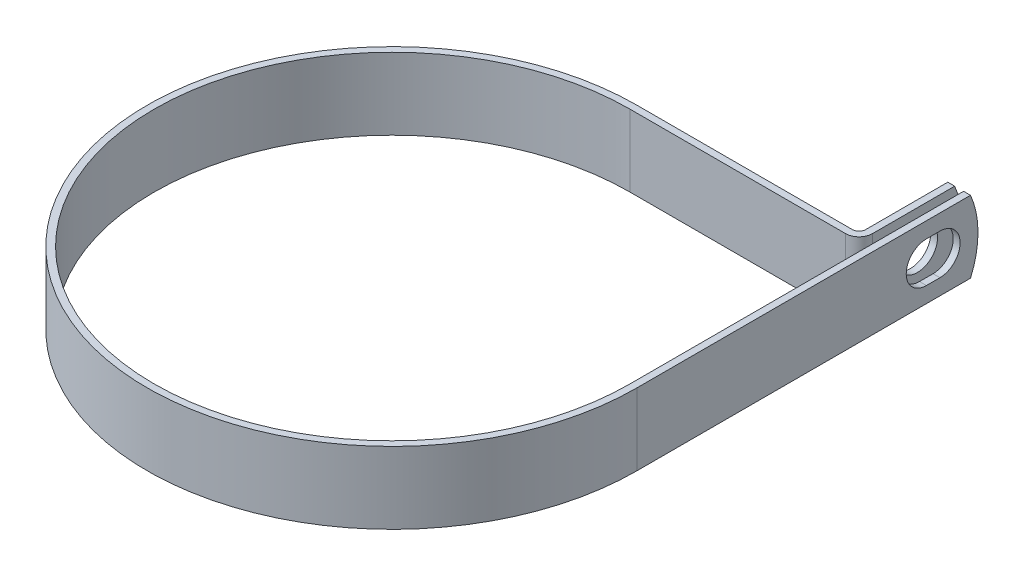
from build123d import *

# Parameters (mm, degrees)
EXTRUDE_THIN1_DEPTH = 6.35
SKETCH2_R           = 3.5687
CUT_EXTRUDE1_DEPTH  = 1.2192
CUT_EXTRUDE2_REACH  = 107.686
CUT_EXTRUDE3_DEPTH  = 103.424932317


with BuildPart() as part:
    # Sketch1 → Extrude-Thin1 (new, symmetric)
    with BuildSketch(Plane(origin=(0, 0, 0), x_dir=(1, 0, 0), z_dir=(0, 1, 0))):
        with BuildLine():
            Line((42.0624, 60.2996), (42.0624, 42.0624))
            Line((42.0624, 42.0624), (42.0624, 0))
            ThreePointArc((42.0624, 0), (-29.742608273, -29.742608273), (0, 42.0624))
            Line((0, 42.0624), (38.11016, 42.0624))
            ThreePointArc((38.11016, 42.0624), (39.791263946, 42.758736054), (40.4876, 44.43984))
            Line((40.4876, 44.43984), (40.4876, 60.2996))
            Line((40.4876, 60.2996), (39.2684, 60.2996))
            Line((39.2684, 60.2996), (39.2684, 44.43984))
            ThreePointArc((39.2684, 44.43984), (38.929159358, 43.620840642), (38.11016, 43.2816))
            Line((38.11016, 43.2816), (0, 43.2816))
            ThreePointArc((0, 43.2816), (-30.604712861, -30.604712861), (43.2816, 0))
            Line((43.2816, 0), (43.2816, 42.0624))
            Line((43.2816, 42.0624), (43.2816, 60.2996))
            Line((43.2816, 60.2996), (42.0624, 60.2996))
        make_face()
    extrude(amount=EXTRUDE_THIN1_DEPTH, both=True)

    # Sketch2 → Cut-Extrude1 (cut)
    with BuildSketch(Plane.ZY.offset(-39.2684)):
        with Locations((-52.3748, 0)):
            Circle(SKETCH2_R)
    extrude(amount=-CUT_EXTRUDE1_DEPTH, mode=Mode.SUBTRACT)

    # Sketch3 → Cut-Extrude2 (cut, up to next)
    with BuildSketch(Plane(origin=(43.2816, 0, 0), x_dir=(0, 0, -1), z_dir=(1, 0, 0)), mode=Mode.PRIVATE) as cut_extrude2_sk1:
        with BuildLine():
            Line((51.181, 3.5687), (53.5686, 3.5687))
            ThreePointArc((53.5686, 3.5687), (57.1373, 0), (53.5686, -3.5687))
            Line((53.5686, -3.5687), (51.181, -3.5687))
            ThreePointArc((51.181, -3.5687), (47.6123, 0), (51.181, 3.5687))
        make_face()
    cut_extrude2_tool1 = extrude(cut_extrude2_sk1.sketch, amount=-CUT_EXTRUDE2_REACH, mode=Mode.PRIVATE) & part.part
    add(cut_extrude2_tool1.solids().sort_by_distance((43.2816, 0, -52.3748))[0], mode=Mode.SUBTRACT)

    # Sketch4 → Cut-Extrude3 (cut, through all)
    with BuildSketch(Plane.ZY.offset(-39.2684)):
        with BuildLine():
            Line((-58.974277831, 6.35), (-60.2996, 6.35))
            Line((-60.2996, 6.35), (-60.2996, 7.1e-08))
            ThreePointArc((-60.2996, 7.1e-08), (-59.964737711, 3.243415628), (-58.974277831, 6.35))
        make_face()
        with BuildLine():
            ThreePointArc((-58.974277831, -6.35), (-59.964737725, -3.243415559), (-60.2996, 7.1e-08))
            Line((-60.2996, 7.1e-08), (-60.2996, -6.35))
            Line((-60.2996, -6.35), (-58.974277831, -6.35))
        make_face()
    extrude(amount=-CUT_EXTRUDE3_DEPTH, mode=Mode.SUBTRACT)


solid = part.part
